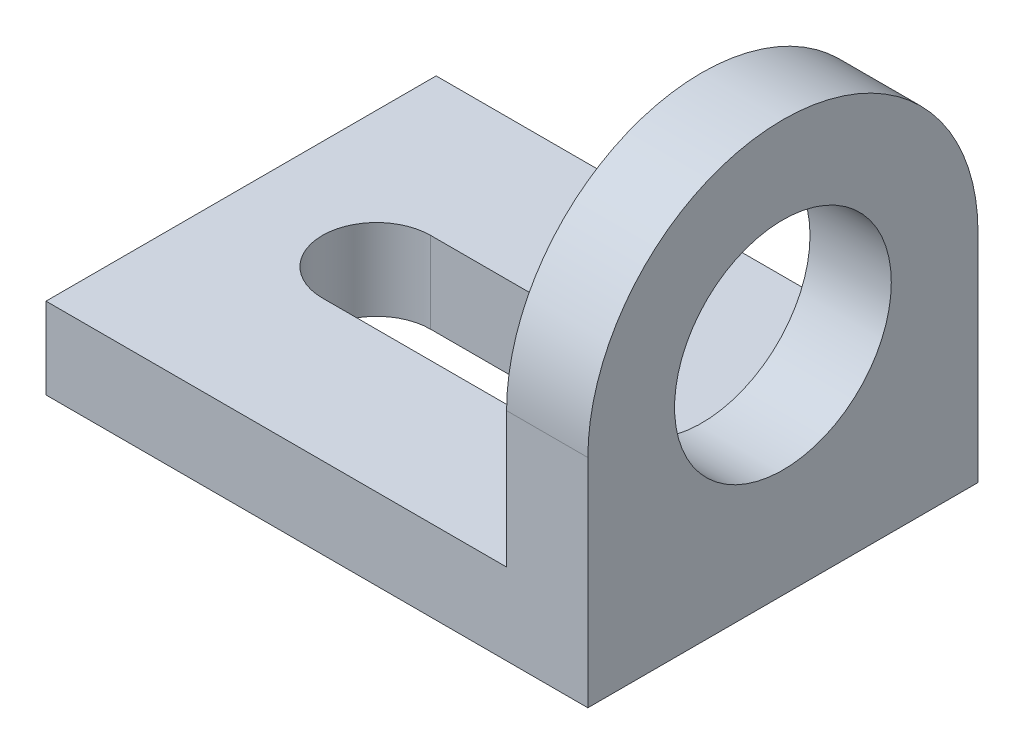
ISO-10303-21;
HEADER;
FILE_DESCRIPTION(('STEP AP214'),'2;1');
FILE_NAME('part.step','',(''),(''),'','','');
FILE_SCHEMA(('AUTOMOTIVE_DESIGN { 1 0 10303 214 1 1 1 1 }'));
ENDSEC;
DATA;
#1=APPLICATION_CONTEXT('core data for automotive mechanical design processes');
#2=APPLICATION_PROTOCOL_DEFINITION('international standard','automotive_design',2000,#1);
#3=PRODUCT_CONTEXT('',#1,'mechanical');
#4=PRODUCT('Part','Part','',(#3));
#5=PRODUCT_RELATED_PRODUCT_CATEGORY('part','',(#4));
#6=PRODUCT_DEFINITION_FORMATION('','',#4);
#7=PRODUCT_DEFINITION_CONTEXT('part definition',#1,'design');
#8=PRODUCT_DEFINITION('design','',#6,#7);
#9=PRODUCT_DEFINITION_SHAPE('','',#8);
#10=(LENGTH_UNIT() NAMED_UNIT(*) SI_UNIT(.MILLI.,.METRE.));
#11=(NAMED_UNIT(*) PLANE_ANGLE_UNIT() SI_UNIT($,.RADIAN.));
#12=(NAMED_UNIT(*) SI_UNIT($,.STERADIAN.) SOLID_ANGLE_UNIT());
#13=UNCERTAINTY_MEASURE_WITH_UNIT(LENGTH_MEASURE(1.E-05),#10,'distance_accuracy_value','');
#14=(GEOMETRIC_REPRESENTATION_CONTEXT(3) GLOBAL_UNCERTAINTY_ASSIGNED_CONTEXT((#13)) GLOBAL_UNIT_ASSIGNED_CONTEXT((#10,
#11,#12)) REPRESENTATION_CONTEXT('',''));
#15=CARTESIAN_POINT('',(0.,0.,0.));
#16=DIRECTION('',(0.,0.,1.));
#17=DIRECTION('',(1.,0.,0.));
#18=AXIS2_PLACEMENT_3D('',#15,#16,#17);
#19=CARTESIAN_POINT('',(-100.,15.,36.));
#20=DIRECTION('',(0.,1.,0.));
#21=DIRECTION('',(0.,0.,1.));
#22=AXIS2_PLACEMENT_3D('',#19,#20,#21);
#23=PLANE('',#22);
#24=DIRECTION('',(1.,0.,0.));
#25=VECTOR('',#24,1.);
#26=CARTESIAN_POINT('',(-35.,15.,10.));
#27=LINE('',#26,#25);
#28=CARTESIAN_POINT('',(-75.,15.,10.));
#29=VERTEX_POINT('',#28);
#30=CARTESIAN_POINT('',(-35.,15.,10.));
#31=VERTEX_POINT('',#30);
#32=EDGE_CURVE('E320',#29,#31,#27,.T.);
#33=ORIENTED_EDGE('',*,*,#32,.F.);
#34=CARTESIAN_POINT('',(-75.,15.,0.));
#35=DIRECTION('',(0.,1.,0.));
#36=DIRECTION('',(0.,0.,-1.));
#37=AXIS2_PLACEMENT_3D('',#34,#35,#36);
#38=CIRCLE('',#37,10.);
#39=CARTESIAN_POINT('',(-75.,15.,-10.));
#40=VERTEX_POINT('',#39);
#41=EDGE_CURVE('E318',#40,#29,#38,.T.);
#42=ORIENTED_EDGE('',*,*,#41,.F.);
#43=DIRECTION('',(-1.,0.,0.));
#44=VECTOR('',#43,1.);
#45=CARTESIAN_POINT('',(-75.,15.,-10.));
#46=LINE('',#45,#44);
#47=CARTESIAN_POINT('',(-35.,15.,-10.));
#48=VERTEX_POINT('',#47);
#49=EDGE_CURVE('E325',#48,#40,#46,.T.);
#50=ORIENTED_EDGE('',*,*,#49,.F.);
#51=CARTESIAN_POINT('',(-35.,15.,0.));
#52=DIRECTION('',(0.,1.,0.));
#53=DIRECTION('',(0.,0.,-1.));
#54=AXIS2_PLACEMENT_3D('',#51,#52,#53);
#55=CIRCLE('',#54,10.);
#56=EDGE_CURVE('E323',#31,#48,#55,.T.);
#57=ORIENTED_EDGE('',*,*,#56,.F.);
#58=EDGE_LOOP('',(#33,#42,#50,#57));
#59=FACE_BOUND('',#58,.T.);
#60=DIRECTION('',(1.,0.,0.));
#61=VECTOR('',#60,1.);
#62=CARTESIAN_POINT('',(-100.,15.,36.));
#63=LINE('',#62,#61);
#64=CARTESIAN_POINT('',(-100.,15.,36.));
#65=VERTEX_POINT('',#64);
#66=CARTESIAN_POINT('',(-15.,15.,36.));
#67=VERTEX_POINT('',#66);
#68=EDGE_CURVE('E141',#65,#67,#63,.T.);
#69=ORIENTED_EDGE('',*,*,#68,.T.);
#70=DIRECTION('',(0.,0.,-1.));
#71=VECTOR('',#70,1.);
#72=CARTESIAN_POINT('',(-15.,15.,-36.));
#73=LINE('',#72,#71);
#74=CARTESIAN_POINT('',(-15.,15.,-36.));
#75=VERTEX_POINT('',#74);
#76=EDGE_CURVE('E131',#67,#75,#73,.T.);
#77=ORIENTED_EDGE('',*,*,#76,.T.);
#78=DIRECTION('',(-1.,0.,0.));
#79=VECTOR('',#78,1.);
#80=CARTESIAN_POINT('',(-100.,15.,-36.));
#81=LINE('',#80,#79);
#82=CARTESIAN_POINT('',(-100.,15.,-36.));
#83=VERTEX_POINT('',#82);
#84=EDGE_CURVE('E130',#75,#83,#81,.T.);
#85=ORIENTED_EDGE('',*,*,#84,.T.);
#86=DIRECTION('',(0.,0.,1.));
#87=VECTOR('',#86,1.);
#88=CARTESIAN_POINT('',(-100.,15.,-36.));
#89=LINE('',#88,#87);
#90=EDGE_CURVE('E145',#83,#65,#89,.T.);
#91=ORIENTED_EDGE('',*,*,#90,.T.);
#92=EDGE_LOOP('',(#69,#77,#85,#91));
#93=FACE_BOUND('',#92,.T.);
#94=ADVANCED_FACE('F31',(#59,#93),#23,.T.);
#95=CARTESIAN_POINT('',(-100.,0.,36.));
#96=DIRECTION('',(0.,1.,0.));
#97=DIRECTION('',(0.,0.,1.));
#98=AXIS2_PLACEMENT_3D('',#95,#96,#97);
#99=PLANE('',#98);
#100=DIRECTION('',(0.,0.,1.));
#101=VECTOR('',#100,1.);
#102=CARTESIAN_POINT('',(-100.,0.,-36.));
#103=LINE('',#102,#101);
#104=CARTESIAN_POINT('',(-100.,0.,-36.));
#105=VERTEX_POINT('',#104);
#106=CARTESIAN_POINT('',(-100.,0.,36.));
#107=VERTEX_POINT('',#106);
#108=EDGE_CURVE('E158',#105,#107,#103,.T.);
#109=ORIENTED_EDGE('',*,*,#108,.F.);
#110=DIRECTION('',(-1.,0.,0.));
#111=VECTOR('',#110,1.);
#112=CARTESIAN_POINT('',(-100.,0.,-36.));
#113=LINE('',#112,#111);
#114=CARTESIAN_POINT('',(0.,0.,-36.));
#115=VERTEX_POINT('',#114);
#116=EDGE_CURVE('E149',#115,#105,#113,.T.);
#117=ORIENTED_EDGE('',*,*,#116,.F.);
#118=DIRECTION('',(0.,0.,-1.));
#119=VECTOR('',#118,1.);
#120=CARTESIAN_POINT('',(0.,0.,-36.));
#121=LINE('',#120,#119);
#122=CARTESIAN_POINT('',(0.,0.,36.));
#123=VERTEX_POINT('',#122);
#124=EDGE_CURVE('E164',#123,#115,#121,.T.);
#125=ORIENTED_EDGE('',*,*,#124,.F.);
#126=DIRECTION('',(1.,0.,0.));
#127=VECTOR('',#126,1.);
#128=CARTESIAN_POINT('',(-100.,0.,36.));
#129=LINE('',#128,#127);
#130=EDGE_CURVE('E161',#107,#123,#129,.T.);
#131=ORIENTED_EDGE('',*,*,#130,.F.);
#132=EDGE_LOOP('',(#109,#117,#125,#131));
#133=FACE_BOUND('',#132,.T.);
#134=CARTESIAN_POINT('',(-75.,0.,0.));
#135=DIRECTION('',(0.,1.,0.));
#136=DIRECTION('',(0.,0.,-1.));
#137=AXIS2_PLACEMENT_3D('',#134,#135,#136);
#138=CIRCLE('',#137,10.);
#139=CARTESIAN_POINT('',(-75.,0.,-10.));
#140=VERTEX_POINT('',#139);
#141=CARTESIAN_POINT('',(-75.,0.,10.));
#142=VERTEX_POINT('',#141);
#143=EDGE_CURVE('E316',#140,#142,#138,.T.);
#144=ORIENTED_EDGE('',*,*,#143,.T.);
#145=DIRECTION('',(1.,0.,0.));
#146=VECTOR('',#145,1.);
#147=CARTESIAN_POINT('',(-35.,0.,10.));
#148=LINE('',#147,#146);
#149=CARTESIAN_POINT('',(-35.,0.,10.));
#150=VERTEX_POINT('',#149);
#151=EDGE_CURVE('E330',#142,#150,#148,.T.);
#152=ORIENTED_EDGE('',*,*,#151,.T.);
#153=CARTESIAN_POINT('',(-35.,0.,0.));
#154=DIRECTION('',(0.,1.,0.));
#155=DIRECTION('',(0.,0.,-1.));
#156=AXIS2_PLACEMENT_3D('',#153,#154,#155);
#157=CIRCLE('',#156,10.);
#158=CARTESIAN_POINT('',(-35.,0.,-10.));
#159=VERTEX_POINT('',#158);
#160=EDGE_CURVE('E333',#150,#159,#157,.T.);
#161=ORIENTED_EDGE('',*,*,#160,.T.);
#162=DIRECTION('',(-1.,0.,0.));
#163=VECTOR('',#162,1.);
#164=CARTESIAN_POINT('',(-75.,0.,-10.));
#165=LINE('',#164,#163);
#166=EDGE_CURVE('E321',#159,#140,#165,.T.);
#167=ORIENTED_EDGE('',*,*,#166,.T.);
#168=EDGE_LOOP('',(#144,#152,#161,#167));
#169=FACE_BOUND('',#168,.T.);
#170=ADVANCED_FACE('F178',(#133,#169),#99,.F.);
#171=CARTESIAN_POINT('',(-100.,15.,-36.));
#172=DIRECTION('',(1.,0.,0.));
#173=DIRECTION('',(0.,0.,-1.));
#174=AXIS2_PLACEMENT_3D('',#171,#172,#173);
#175=PLANE('',#174);
#176=ORIENTED_EDGE('',*,*,#108,.T.);
#177=DIRECTION('',(0.,-1.,0.));
#178=VECTOR('',#177,1.);
#179=CARTESIAN_POINT('',(-100.,15.,36.));
#180=LINE('',#179,#178);
#181=EDGE_CURVE('E11',#65,#107,#180,.T.);
#182=ORIENTED_EDGE('',*,*,#181,.F.);
#183=ORIENTED_EDGE('',*,*,#90,.F.);
#184=DIRECTION('',(0.,-1.,0.));
#185=VECTOR('',#184,1.);
#186=CARTESIAN_POINT('',(-100.,15.,-36.));
#187=LINE('',#186,#185);
#188=EDGE_CURVE('E148',#83,#105,#187,.T.);
#189=ORIENTED_EDGE('',*,*,#188,.T.);
#190=EDGE_LOOP('',(#176,#182,#183,#189));
#191=FACE_BOUND('',#190,.T.);
#192=ADVANCED_FACE('F33',(#191),#175,.F.);
#193=CARTESIAN_POINT('',(-100.,15.,36.));
#194=DIRECTION('',(0.,0.,-1.));
#195=DIRECTION('',(-1.,0.,0.));
#196=AXIS2_PLACEMENT_3D('',#193,#194,#195);
#197=PLANE('',#196);
#198=ORIENTED_EDGE('',*,*,#130,.T.);
#199=DIRECTION('',(0.,-1.,0.));
#200=VECTOR('',#199,1.);
#201=CARTESIAN_POINT('',(0.,15.,36.));
#202=LINE('',#201,#200);
#203=CARTESIAN_POINT('',(0.,40.,36.));
#204=VERTEX_POINT('',#203);
#205=EDGE_CURVE('E40',#204,#123,#202,.T.);
#206=ORIENTED_EDGE('',*,*,#205,.F.);
#207=DIRECTION('',(1.,0.,0.));
#208=VECTOR('',#207,1.);
#209=CARTESIAN_POINT('',(-15.,40.,36.));
#210=LINE('',#209,#208);
#211=CARTESIAN_POINT('',(-15.,40.,36.));
#212=VERTEX_POINT('',#211);
#213=EDGE_CURVE('E121',#212,#204,#210,.T.);
#214=ORIENTED_EDGE('',*,*,#213,.F.);
#215=DIRECTION('',(0.,-1.,0.));
#216=VECTOR('',#215,1.);
#217=CARTESIAN_POINT('',(-15.,15.,36.));
#218=LINE('',#217,#216);
#219=EDGE_CURVE('E122',#212,#67,#218,.T.);
#220=ORIENTED_EDGE('',*,*,#219,.T.);
#221=ORIENTED_EDGE('',*,*,#68,.F.);
#222=ORIENTED_EDGE('',*,*,#181,.T.);
#223=EDGE_LOOP('',(#198,#206,#214,#220,#221,#222));
#224=FACE_BOUND('',#223,.T.);
#225=ADVANCED_FACE('F140',(#224),#197,.F.);
#226=CARTESIAN_POINT('',(0.,15.,-36.));
#227=DIRECTION('',(-1.,0.,0.));
#228=DIRECTION('',(0.,0.,1.));
#229=AXIS2_PLACEMENT_3D('',#226,#227,#228);
#230=PLANE('',#229);
#231=ORIENTED_EDGE('',*,*,#124,.T.);
#232=DIRECTION('',(0.,-1.,0.));
#233=VECTOR('',#232,1.);
#234=CARTESIAN_POINT('',(0.,15.,-36.));
#235=LINE('',#234,#233);
#236=CARTESIAN_POINT('',(0.,40.,-36.));
#237=VERTEX_POINT('',#236);
#238=EDGE_CURVE('E169',#237,#115,#235,.T.);
#239=ORIENTED_EDGE('',*,*,#238,.F.);
#240=CARTESIAN_POINT('',(0.,40.,0.));
#241=DIRECTION('',(1.,0.,0.));
#242=DIRECTION('',(0.,0.,1.));
#243=AXIS2_PLACEMENT_3D('',#240,#241,#242);
#244=CIRCLE('',#243,36.);
#245=EDGE_CURVE('E118',#237,#204,#244,.T.);
#246=ORIENTED_EDGE('',*,*,#245,.T.);
#247=ORIENTED_EDGE('',*,*,#205,.T.);
#248=EDGE_LOOP('',(#231,#239,#246,#247));
#249=FACE_BOUND('',#248,.T.);
#250=CARTESIAN_POINT('',(0.,40.,0.));
#251=DIRECTION('',(1.,0.,0.));
#252=DIRECTION('',(0.,0.,-1.));
#253=AXIS2_PLACEMENT_3D('',#250,#251,#252);
#254=CIRCLE('',#253,20.);
#255=CARTESIAN_POINT('',(0.,40.,-20.));
#256=VERTEX_POINT('',#255);
#257=EDGE_CURVE('E310',#256,#256,#254,.T.);
#258=ORIENTED_EDGE('',*,*,#257,.F.);
#259=EDGE_LOOP('',(#258));
#260=FACE_BOUND('',#259,.T.);
#261=ADVANCED_FACE('F173',(#249,#260),#230,.F.);
#262=CARTESIAN_POINT('',(-100.,15.,-36.));
#263=DIRECTION('',(0.,0.,1.));
#264=DIRECTION('',(1.,0.,0.));
#265=AXIS2_PLACEMENT_3D('',#262,#263,#264);
#266=PLANE('',#265);
#267=ORIENTED_EDGE('',*,*,#116,.T.);
#268=ORIENTED_EDGE('',*,*,#188,.F.);
#269=ORIENTED_EDGE('',*,*,#84,.F.);
#270=DIRECTION('',(0.,1.,0.));
#271=VECTOR('',#270,1.);
#272=CARTESIAN_POINT('',(-15.,40.,-36.));
#273=LINE('',#272,#271);
#274=CARTESIAN_POINT('',(-15.,40.,-36.));
#275=VERTEX_POINT('',#274);
#276=EDGE_CURVE('E48',#75,#275,#273,.T.);
#277=ORIENTED_EDGE('',*,*,#276,.T.);
#278=DIRECTION('',(1.,0.,0.));
#279=VECTOR('',#278,1.);
#280=CARTESIAN_POINT('',(-15.,40.,-36.));
#281=LINE('',#280,#279);
#282=EDGE_CURVE('E112',#275,#237,#281,.T.);
#283=ORIENTED_EDGE('',*,*,#282,.T.);
#284=ORIENTED_EDGE('',*,*,#238,.T.);
#285=EDGE_LOOP('',(#267,#268,#269,#277,#283,#284));
#286=FACE_BOUND('',#285,.T.);
#287=ADVANCED_FACE('F128',(#286),#266,.F.);
#288=CARTESIAN_POINT('',(-75.,15.,0.));
#289=DIRECTION('',(0.,-1.,0.));
#290=DIRECTION('',(0.,0.,-1.));
#291=AXIS2_PLACEMENT_3D('',#288,#289,#290);
#292=CYLINDRICAL_SURFACE('',#291,10.);
#293=ORIENTED_EDGE('',*,*,#143,.F.);
#294=DIRECTION('',(0.,-1.,0.));
#295=VECTOR('',#294,1.);
#296=CARTESIAN_POINT('',(-75.,15.,-10.));
#297=LINE('',#296,#295);
#298=EDGE_CURVE('E327',#40,#140,#297,.T.);
#299=ORIENTED_EDGE('',*,*,#298,.F.);
#300=ORIENTED_EDGE('',*,*,#41,.T.);
#301=DIRECTION('',(0.,-1.,0.));
#302=VECTOR('',#301,1.);
#303=CARTESIAN_POINT('',(-75.,15.,10.));
#304=LINE('',#303,#302);
#305=EDGE_CURVE('E162',#29,#142,#304,.T.);
#306=ORIENTED_EDGE('',*,*,#305,.T.);
#307=EDGE_LOOP('',(#293,#299,#300,#306));
#308=FACE_BOUND('',#307,.T.);
#309=ADVANCED_FACE('F194',(#308),#292,.F.);
#310=CARTESIAN_POINT('',(-35.,15.,10.));
#311=DIRECTION('',(0.,0.,-1.));
#312=DIRECTION('',(-1.,0.,0.));
#313=AXIS2_PLACEMENT_3D('',#310,#311,#312);
#314=PLANE('',#313);
#315=ORIENTED_EDGE('',*,*,#151,.F.);
#316=ORIENTED_EDGE('',*,*,#305,.F.);
#317=ORIENTED_EDGE('',*,*,#32,.T.);
#318=DIRECTION('',(0.,-1.,0.));
#319=VECTOR('',#318,1.);
#320=CARTESIAN_POINT('',(-35.,15.,10.));
#321=LINE('',#320,#319);
#322=EDGE_CURVE('E341',#31,#150,#321,.T.);
#323=ORIENTED_EDGE('',*,*,#322,.T.);
#324=EDGE_LOOP('',(#315,#316,#317,#323));
#325=FACE_BOUND('',#324,.T.);
#326=ADVANCED_FACE('F215',(#325),#314,.T.);
#327=CARTESIAN_POINT('',(-35.,15.,0.));
#328=DIRECTION('',(0.,-1.,0.));
#329=DIRECTION('',(0.,0.,-1.));
#330=AXIS2_PLACEMENT_3D('',#327,#328,#329);
#331=CYLINDRICAL_SURFACE('',#330,10.);
#332=ORIENTED_EDGE('',*,*,#160,.F.);
#333=ORIENTED_EDGE('',*,*,#322,.F.);
#334=ORIENTED_EDGE('',*,*,#56,.T.);
#335=DIRECTION('',(0.,-1.,0.));
#336=VECTOR('',#335,1.);
#337=CARTESIAN_POINT('',(-35.,15.,-10.));
#338=LINE('',#337,#336);
#339=EDGE_CURVE('E56',#48,#159,#338,.T.);
#340=ORIENTED_EDGE('',*,*,#339,.T.);
#341=EDGE_LOOP('',(#332,#333,#334,#340));
#342=FACE_BOUND('',#341,.T.);
#343=ADVANCED_FACE('F222',(#342),#331,.F.);
#344=CARTESIAN_POINT('',(-75.,15.,-10.));
#345=DIRECTION('',(0.,0.,1.));
#346=DIRECTION('',(1.,0.,0.));
#347=AXIS2_PLACEMENT_3D('',#344,#345,#346);
#348=PLANE('',#347);
#349=ORIENTED_EDGE('',*,*,#166,.F.);
#350=ORIENTED_EDGE('',*,*,#339,.F.);
#351=ORIENTED_EDGE('',*,*,#49,.T.);
#352=ORIENTED_EDGE('',*,*,#298,.T.);
#353=EDGE_LOOP('',(#349,#350,#351,#352));
#354=FACE_BOUND('',#353,.T.);
#355=ADVANCED_FACE('F229',(#354),#348,.T.);
#356=CARTESIAN_POINT('',(-15.,40.,0.));
#357=DIRECTION('',(1.,0.,0.));
#358=DIRECTION('',(0.,0.,-1.));
#359=AXIS2_PLACEMENT_3D('',#356,#357,#358);
#360=CYLINDRICAL_SURFACE('',#359,36.);
#361=ORIENTED_EDGE('',*,*,#245,.F.);
#362=ORIENTED_EDGE('',*,*,#282,.F.);
#363=CARTESIAN_POINT('',(-15.,40.,0.));
#364=DIRECTION('',(1.,0.,0.));
#365=DIRECTION('',(0.,0.,1.));
#366=AXIS2_PLACEMENT_3D('',#363,#364,#365);
#367=CIRCLE('',#366,36.);
#368=EDGE_CURVE('E115',#275,#212,#367,.T.);
#369=ORIENTED_EDGE('',*,*,#368,.T.);
#370=ORIENTED_EDGE('',*,*,#213,.T.);
#371=EDGE_LOOP('',(#361,#362,#369,#370));
#372=FACE_BOUND('',#371,.T.);
#373=ADVANCED_FACE('F113',(#372),#360,.T.);
#374=CARTESIAN_POINT('',(-15.,40.,0.));
#375=DIRECTION('',(-1.,0.,0.));
#376=DIRECTION('',(0.,0.,1.));
#377=AXIS2_PLACEMENT_3D('',#374,#375,#376);
#378=PLANE('',#377);
#379=CARTESIAN_POINT('',(-15.,40.,0.));
#380=DIRECTION('',(1.,0.,0.));
#381=DIRECTION('',(0.,0.,-1.));
#382=AXIS2_PLACEMENT_3D('',#379,#380,#381);
#383=CIRCLE('',#382,20.);
#384=CARTESIAN_POINT('',(-15.,40.,-20.));
#385=VERTEX_POINT('',#384);
#386=EDGE_CURVE('E307',#385,#385,#383,.T.);
#387=ORIENTED_EDGE('',*,*,#386,.T.);
#388=EDGE_LOOP('',(#387));
#389=FACE_BOUND('',#388,.T.);
#390=ORIENTED_EDGE('',*,*,#76,.F.);
#391=ORIENTED_EDGE('',*,*,#219,.F.);
#392=ORIENTED_EDGE('',*,*,#368,.F.);
#393=ORIENTED_EDGE('',*,*,#276,.F.);
#394=EDGE_LOOP('',(#390,#391,#392,#393));
#395=FACE_BOUND('',#394,.T.);
#396=ADVANCED_FACE('F124',(#389,#395),#378,.T.);
#397=CARTESIAN_POINT('',(-15.,40.,0.));
#398=DIRECTION('',(1.,0.,0.));
#399=DIRECTION('',(0.,0.,-1.));
#400=AXIS2_PLACEMENT_3D('',#397,#398,#399);
#401=CYLINDRICAL_SURFACE('',#400,20.);
#402=ORIENTED_EDGE('',*,*,#386,.F.);
#403=EDGE_LOOP('',(#402));
#404=FACE_BOUND('',#403,.T.);
#405=ORIENTED_EDGE('',*,*,#257,.T.);
#406=EDGE_LOOP('',(#405));
#407=FACE_BOUND('',#406,.T.);
#408=ADVANCED_FACE('F248',(#404,#407),#401,.F.);
#409=CLOSED_SHELL('',(#94,#170,#192,#225,#261,#287,#309,#326,#343,#355,#373,#396,#408));
#410=MANIFOLD_SOLID_BREP('B2',#409);
#411=ADVANCED_BREP_SHAPE_REPRESENTATION('',(#18,#410),#14);
#412=SHAPE_DEFINITION_REPRESENTATION(#9,#411);
ENDSEC;
END-ISO-10303-21;
